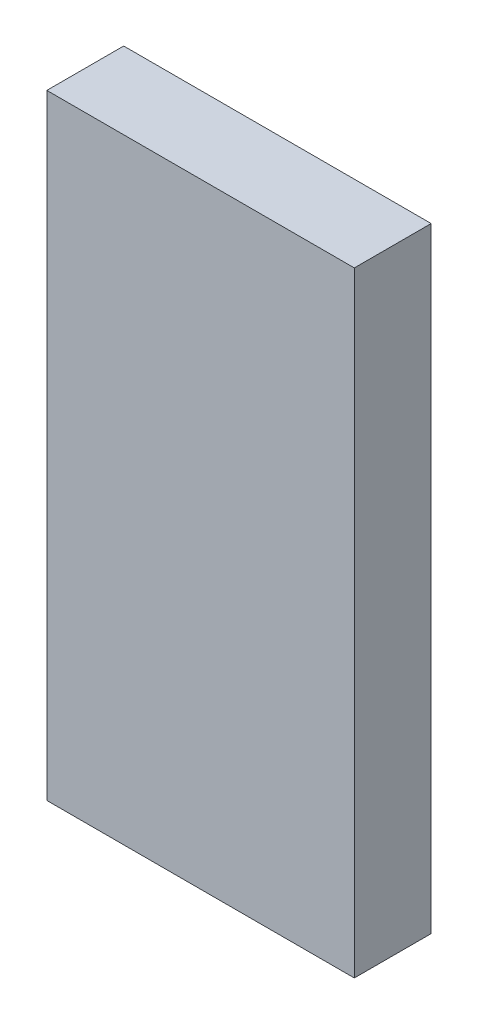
ISO-10303-21;
HEADER;
FILE_DESCRIPTION(('STEP AP214'),'2;1');
FILE_NAME('part.step','',(''),(''),'','','');
FILE_SCHEMA(('AUTOMOTIVE_DESIGN { 1 0 10303 214 1 1 1 1 }'));
ENDSEC;
DATA;
#1=APPLICATION_CONTEXT('core data for automotive mechanical design processes');
#2=APPLICATION_PROTOCOL_DEFINITION('international standard','automotive_design',2000,#1);
#3=PRODUCT_CONTEXT('',#1,'mechanical');
#4=PRODUCT('Part','Part','',(#3));
#5=PRODUCT_RELATED_PRODUCT_CATEGORY('part','',(#4));
#6=PRODUCT_DEFINITION_FORMATION('','',#4);
#7=PRODUCT_DEFINITION_CONTEXT('part definition',#1,'design');
#8=PRODUCT_DEFINITION('design','',#6,#7);
#9=PRODUCT_DEFINITION_SHAPE('','',#8);
#10=(LENGTH_UNIT() NAMED_UNIT(*) SI_UNIT(.MILLI.,.METRE.));
#11=(NAMED_UNIT(*) PLANE_ANGLE_UNIT() SI_UNIT($,.RADIAN.));
#12=(NAMED_UNIT(*) SI_UNIT($,.STERADIAN.) SOLID_ANGLE_UNIT());
#13=UNCERTAINTY_MEASURE_WITH_UNIT(LENGTH_MEASURE(1.E-05),#10,'distance_accuracy_value','');
#14=(GEOMETRIC_REPRESENTATION_CONTEXT(3) GLOBAL_UNCERTAINTY_ASSIGNED_CONTEXT((#13)) GLOBAL_UNIT_ASSIGNED_CONTEXT((#10,
#11,#12)) REPRESENTATION_CONTEXT('',''));
#15=CARTESIAN_POINT('',(0.,0.,0.));
#16=DIRECTION('',(0.,0.,1.));
#17=DIRECTION('',(1.,0.,0.));
#18=AXIS2_PLACEMENT_3D('',#15,#16,#17);
#19=CARTESIAN_POINT('',(0.,0.,0.));
#20=DIRECTION('',(0.,0.,1.));
#21=DIRECTION('',(1.,0.,0.));
#22=AXIS2_PLACEMENT_3D('',#19,#20,#21);
#23=PLANE('',#22);
#24=CARTESIAN_POINT('',(0.0967270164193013,-60.825231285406,0.));
#25=DIRECTION('',(0.,0.,-1.));
#26=DIRECTION('',(-1.,0.,0.));
#27=AXIS2_PLACEMENT_3D('',#24,#25,#26);
#28=CIRCLE('',#27,3.1623);
#29=CARTESIAN_POINT('',(-3.0655729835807,-60.825231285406,0.));
#30=VERTEX_POINT('',#29);
#31=EDGE_CURVE('E344',#30,#30,#28,.T.);
#32=ORIENTED_EDGE('',*,*,#31,.F.);
#33=EDGE_LOOP('',(#32));
#34=FACE_BOUND('',#33,.T.);
#35=DIRECTION('',(0.,-1.,0.));
#36=VECTOR('',#35,1.);
#37=CARTESIAN_POINT('',(-43.2610729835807,34.424768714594,0.));
#38=LINE('',#37,#36);
#39=CARTESIAN_POINT('',(-43.2610729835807,34.424768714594,0.));
#40=VERTEX_POINT('',#39);
#41=CARTESIAN_POINT('',(-43.2610729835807,-67.175231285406,0.));
#42=VERTEX_POINT('',#41);
#43=EDGE_CURVE('E122',#40,#42,#38,.T.);
#44=ORIENTED_EDGE('',*,*,#43,.F.);
#45=DIRECTION('',(-1.,0.,0.));
#46=VECTOR('',#45,1.);
#47=CARTESIAN_POINT('',(-43.2610729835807,34.424768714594,0.));
#48=LINE('',#47,#46);
#49=CARTESIAN_POINT('',(7.5389270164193,34.424768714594,0.));
#50=VERTEX_POINT('',#49);
#51=EDGE_CURVE('E82',#50,#40,#48,.T.);
#52=ORIENTED_EDGE('',*,*,#51,.F.);
#53=DIRECTION('',(0.,1.,0.));
#54=VECTOR('',#53,1.);
#55=CARTESIAN_POINT('',(7.5389270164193,34.424768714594,0.));
#56=LINE('',#55,#54);
#57=CARTESIAN_POINT('',(7.5389270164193,-67.175231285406,0.));
#58=VERTEX_POINT('',#57);
#59=EDGE_CURVE('E76',#58,#50,#56,.T.);
#60=ORIENTED_EDGE('',*,*,#59,.F.);
#61=DIRECTION('',(1.,0.,0.));
#62=VECTOR('',#61,1.);
#63=CARTESIAN_POINT('',(-43.2610729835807,-67.175231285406,0.));
#64=LINE('',#63,#62);
#65=EDGE_CURVE('E132',#42,#58,#64,.T.);
#66=ORIENTED_EDGE('',*,*,#65,.F.);
#67=EDGE_LOOP('',(#44,#52,#60,#66));
#68=FACE_BOUND('',#67,.T.);
#69=CARTESIAN_POINT('',(-35.8242974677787,-60.825231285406,0.));
#70=DIRECTION('',(0.,0.,-1.));
#71=DIRECTION('',(-1.,0.,0.));
#72=AXIS2_PLACEMENT_3D('',#69,#70,#71);
#73=CIRCLE('',#72,3.1623);
#74=CARTESIAN_POINT('',(-38.9865974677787,-60.825231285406,0.));
#75=VERTEX_POINT('',#74);
#76=EDGE_CURVE('E334',#75,#75,#73,.T.);
#77=ORIENTED_EDGE('',*,*,#76,.F.);
#78=EDGE_LOOP('',(#77));
#79=FACE_BOUND('',#78,.T.);
#80=ADVANCED_FACE('F41',(#34,#68,#79),#23,.F.);
#81=CARTESIAN_POINT('',(-43.2610729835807,34.424768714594,12.7));
#82=DIRECTION('',(1.,0.,0.));
#83=DIRECTION('',(0.,0.,-1.));
#84=AXIS2_PLACEMENT_3D('',#81,#82,#83);
#85=PLANE('',#84);
#86=ORIENTED_EDGE('',*,*,#43,.T.);
#87=DIRECTION('',(0.,0.,-1.));
#88=VECTOR('',#87,1.);
#89=CARTESIAN_POINT('',(-43.2610729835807,-67.175231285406,12.7));
#90=LINE('',#89,#88);
#91=CARTESIAN_POINT('',(-43.2610729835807,-67.175231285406,12.7));
#92=VERTEX_POINT('',#91);
#93=EDGE_CURVE('E11',#92,#42,#90,.T.);
#94=ORIENTED_EDGE('',*,*,#93,.F.);
#95=DIRECTION('',(0.,-1.,0.));
#96=VECTOR('',#95,1.);
#97=CARTESIAN_POINT('',(-43.2610729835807,34.424768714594,12.7));
#98=LINE('',#97,#96);
#99=CARTESIAN_POINT('',(-43.2610729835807,34.424768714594,12.7));
#100=VERTEX_POINT('',#99);
#101=EDGE_CURVE('E123',#100,#92,#98,.T.);
#102=ORIENTED_EDGE('',*,*,#101,.F.);
#103=DIRECTION('',(0.,0.,-1.));
#104=VECTOR('',#103,1.);
#105=CARTESIAN_POINT('',(-43.2610729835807,34.424768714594,12.7));
#106=LINE('',#105,#104);
#107=EDGE_CURVE('E129',#100,#40,#106,.T.);
#108=ORIENTED_EDGE('',*,*,#107,.T.);
#109=EDGE_LOOP('',(#86,#94,#102,#108));
#110=FACE_BOUND('',#109,.T.);
#111=ADVANCED_FACE('F43',(#110),#85,.F.);
#112=CARTESIAN_POINT('',(-43.2610729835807,-67.175231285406,12.7));
#113=DIRECTION('',(0.,1.,0.));
#114=DIRECTION('',(0.,0.,1.));
#115=AXIS2_PLACEMENT_3D('',#112,#113,#114);
#116=PLANE('',#115);
#117=CARTESIAN_POINT('',(0.0967270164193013,-67.175231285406,6.35));
#118=DIRECTION('',(0.,-1.,0.));
#119=DIRECTION('',(0.,0.,-1.));
#120=AXIS2_PLACEMENT_3D('',#117,#118,#119);
#121=CIRCLE('',#120,3.1623);
#122=CARTESIAN_POINT('',(0.0967270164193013,-67.175231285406,3.1877));
#123=VERTEX_POINT('',#122);
#124=EDGE_CURVE('E113',#123,#123,#121,.T.);
#125=ORIENTED_EDGE('',*,*,#124,.F.);
#126=EDGE_LOOP('',(#125));
#127=FACE_BOUND('',#126,.T.);
#128=CARTESIAN_POINT('',(-35.8242974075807,-67.175231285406,6.35));
#129=DIRECTION('',(0.,-1.,0.));
#130=DIRECTION('',(0.,0.,-1.));
#131=AXIS2_PLACEMENT_3D('',#128,#129,#130);
#132=CIRCLE('',#131,3.1623);
#133=CARTESIAN_POINT('',(-35.8242974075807,-67.175231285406,3.1877));
#134=VERTEX_POINT('',#133);
#135=EDGE_CURVE('E106',#134,#134,#132,.T.);
#136=ORIENTED_EDGE('',*,*,#135,.F.);
#137=EDGE_LOOP('',(#136));
#138=FACE_BOUND('',#137,.T.);
#139=ORIENTED_EDGE('',*,*,#65,.T.);
#140=DIRECTION('',(0.,0.,-1.));
#141=VECTOR('',#140,1.);
#142=CARTESIAN_POINT('',(7.5389270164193,-67.175231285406,12.7));
#143=LINE('',#142,#141);
#144=CARTESIAN_POINT('',(7.5389270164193,-67.175231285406,12.7));
#145=VERTEX_POINT('',#144);
#146=EDGE_CURVE('E50',#145,#58,#143,.T.);
#147=ORIENTED_EDGE('',*,*,#146,.F.);
#148=DIRECTION('',(1.,0.,0.));
#149=VECTOR('',#148,1.);
#150=CARTESIAN_POINT('',(-43.2610729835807,-67.175231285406,12.7));
#151=LINE('',#150,#149);
#152=EDGE_CURVE('E89',#92,#145,#151,.T.);
#153=ORIENTED_EDGE('',*,*,#152,.F.);
#154=ORIENTED_EDGE('',*,*,#93,.T.);
#155=EDGE_LOOP('',(#139,#147,#153,#154));
#156=FACE_BOUND('',#155,.T.);
#157=ADVANCED_FACE('F156',(#127,#138,#156),#116,.F.);
#158=CARTESIAN_POINT('',(7.5389270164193,34.424768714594,12.7));
#159=DIRECTION('',(-1.,0.,0.));
#160=DIRECTION('',(0.,0.,1.));
#161=AXIS2_PLACEMENT_3D('',#158,#159,#160);
#162=PLANE('',#161);
#163=ORIENTED_EDGE('',*,*,#59,.T.);
#164=DIRECTION('',(0.,0.,-1.));
#165=VECTOR('',#164,1.);
#166=CARTESIAN_POINT('',(7.5389270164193,34.424768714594,12.7));
#167=LINE('',#166,#165);
#168=CARTESIAN_POINT('',(7.5389270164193,34.424768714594,12.7));
#169=VERTEX_POINT('',#168);
#170=EDGE_CURVE('E137',#169,#50,#167,.T.);
#171=ORIENTED_EDGE('',*,*,#170,.F.);
#172=DIRECTION('',(0.,1.,0.));
#173=VECTOR('',#172,1.);
#174=CARTESIAN_POINT('',(7.5389270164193,34.424768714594,12.7));
#175=LINE('',#174,#173);
#176=EDGE_CURVE('E126',#145,#169,#175,.T.);
#177=ORIENTED_EDGE('',*,*,#176,.F.);
#178=ORIENTED_EDGE('',*,*,#146,.T.);
#179=EDGE_LOOP('',(#163,#171,#177,#178));
#180=FACE_BOUND('',#179,.T.);
#181=ADVANCED_FACE('F139',(#180),#162,.F.);
#182=CARTESIAN_POINT('',(-43.2610729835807,34.424768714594,12.7));
#183=DIRECTION('',(0.,-1.,0.));
#184=DIRECTION('',(0.,0.,-1.));
#185=AXIS2_PLACEMENT_3D('',#182,#183,#184);
#186=PLANE('',#185);
#187=ORIENTED_EDGE('',*,*,#51,.T.);
#188=ORIENTED_EDGE('',*,*,#107,.F.);
#189=DIRECTION('',(-1.,0.,0.));
#190=VECTOR('',#189,1.);
#191=CARTESIAN_POINT('',(-43.2610729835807,34.424768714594,12.7));
#192=LINE('',#191,#190);
#193=EDGE_CURVE('E58',#169,#100,#192,.T.);
#194=ORIENTED_EDGE('',*,*,#193,.F.);
#195=ORIENTED_EDGE('',*,*,#170,.T.);
#196=EDGE_LOOP('',(#187,#188,#194,#195));
#197=FACE_BOUND('',#196,.T.);
#198=ADVANCED_FACE('F146',(#197),#186,.F.);
#199=CARTESIAN_POINT('',(0.,0.,12.7));
#200=DIRECTION('',(0.,0.,1.));
#201=DIRECTION('',(1.,0.,0.));
#202=AXIS2_PLACEMENT_3D('',#199,#200,#201);
#203=PLANE('',#202);
#204=ORIENTED_EDGE('',*,*,#101,.T.);
#205=ORIENTED_EDGE('',*,*,#152,.T.);
#206=ORIENTED_EDGE('',*,*,#176,.T.);
#207=ORIENTED_EDGE('',*,*,#193,.T.);
#208=EDGE_LOOP('',(#204,#205,#206,#207));
#209=FACE_BOUND('',#208,.T.);
#210=ADVANCED_FACE('F148',(#209),#203,.T.);
#211=CARTESIAN_POINT('',(-35.8242974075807,-54.475231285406,6.35));
#212=DIRECTION('',(0.,-1.,0.));
#213=DIRECTION('',(0.,0.,-1.));
#214=AXIS2_PLACEMENT_3D('',#211,#212,#213);
#215=CONICAL_SURFACE('',#214,2.5273,1.02974425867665);
#216=CARTESIAN_POINT('',(-35.8242974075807,-52.9566762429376,6.35));
#217=VERTEX_POINT('',#216);
#218=VERTEX_LOOP('',#217);
#219=FACE_BOUND('',#218,.T.);
#220=CARTESIAN_POINT('',(-35.8242974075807,-54.475231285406,6.35));
#221=DIRECTION('',(0.,-1.,0.));
#222=DIRECTION('',(0.,0.,-1.));
#223=AXIS2_PLACEMENT_3D('',#220,#221,#222);
#224=CIRCLE('',#223,2.5273);
#225=CARTESIAN_POINT('',(-35.8242974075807,-54.475231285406,3.8227));
#226=VERTEX_POINT('',#225);
#227=EDGE_CURVE('E119',#226,#226,#224,.T.);
#228=ORIENTED_EDGE('',*,*,#227,.T.);
#229=EDGE_LOOP('',(#228));
#230=FACE_BOUND('',#229,.T.);
#231=ADVANCED_FACE('F154',(#219,#230),#215,.F.);
#232=CARTESIAN_POINT('',(-35.8242974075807,-67.175231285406,6.35));
#233=DIRECTION('',(0.,-1.,0.));
#234=DIRECTION('',(0.,0.,-1.));
#235=AXIS2_PLACEMENT_3D('',#232,#233,#234);
#236=CYLINDRICAL_SURFACE('',#235,2.5273);
#237=CARTESIAN_POINT('',(-35.8242974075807,-59.098031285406,3.8227));
#238=CARTESIAN_POINT('',(-35.7379835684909,-59.0980323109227,3.82270104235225));
#239=CARTESIAN_POINT('',(-35.6516591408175,-59.1045385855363,3.82716059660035));
#240=CARTESIAN_POINT('',(-35.4817706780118,-59.1301540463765,3.84456075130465));
#241=CARTESIAN_POINT('',(-35.3982083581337,-59.1492709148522,3.85750652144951));
#242=CARTESIAN_POINT('',(-35.2365707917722,-59.1989110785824,3.89060908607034));
#243=CARTESIAN_POINT('',(-35.158471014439,-59.2293788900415,3.91073078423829));
#244=CARTESIAN_POINT('',(-35.0088409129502,-59.3003978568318,3.95659064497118));
#245=CARTESIAN_POINT('',(-34.9373113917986,-59.3409502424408,3.98232949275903));
#246=CARTESIAN_POINT('',(-34.7958423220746,-59.434792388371,4.04005288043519));
#247=CARTESIAN_POINT('',(-34.726578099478,-59.488881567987,4.07238541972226));
#248=CARTESIAN_POINT('',(-34.5974760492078,-59.6063139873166,4.13924161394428));
#249=CARTESIAN_POINT('',(-34.5376523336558,-59.6696708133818,4.17376844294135));
#250=CARTESIAN_POINT('',(-34.4189002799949,-59.8160741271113,4.24814761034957));
#251=CARTESIAN_POINT('',(-34.3617884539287,-59.9006419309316,4.28792681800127));
#252=CARTESIAN_POINT('',(-34.2626074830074,-60.0803596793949,4.36198647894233));
#253=CARTESIAN_POINT('',(-34.2205125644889,-60.1754911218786,4.39627629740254));
#254=CARTESIAN_POINT('',(-34.1635875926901,-60.3449471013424,4.44467970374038));
#255=CARTESIAN_POINT('',(-34.1443659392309,-60.4169394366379,4.46175993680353));
#256=CARTESIAN_POINT('',(-34.1153045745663,-60.5641423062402,4.48801697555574));
#257=CARTESIAN_POINT('',(-34.1054477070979,-60.6393466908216,4.49720823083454));
#258=CARTESIAN_POINT('',(-34.0957445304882,-60.7913567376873,4.5062532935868));
#259=CARTESIAN_POINT('',(-34.09594710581,-60.8681684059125,4.50606150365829));
#260=CARTESIAN_POINT('',(-34.1064708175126,-61.0205028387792,4.49625733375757));
#261=CARTESIAN_POINT('',(-34.1167992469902,-61.0960246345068,4.4866381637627));
#262=CARTESIAN_POINT('',(-34.1460219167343,-61.239588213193,4.46029368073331));
#263=CARTESIAN_POINT('',(-34.164417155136,-61.3078132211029,4.44398547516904));
#264=CARTESIAN_POINT('',(-34.2087897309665,-61.44024330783,4.40623335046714));
#265=CARTESIAN_POINT('',(-34.234772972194,-61.5044452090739,4.38478543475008));
#266=CARTESIAN_POINT('',(-34.3082387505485,-61.6590920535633,4.32714888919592));
#267=CARTESIAN_POINT('',(-34.3599928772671,-61.746760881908,4.28892504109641));
#268=CARTESIAN_POINT('',(-34.4774371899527,-61.9112453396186,4.21032098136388));
#269=CARTESIAN_POINT('',(-34.5431536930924,-61.9880400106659,4.16993680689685));
#270=CARTESIAN_POINT('',(-34.6882626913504,-62.130241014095,4.09089319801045));
#271=CARTESIAN_POINT('',(-34.7677748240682,-62.1955367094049,4.05225292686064));
#272=CARTESIAN_POINT('',(-34.9389409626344,-62.3118446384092,3.98104725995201));
#273=CARTESIAN_POINT('',(-35.0305692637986,-62.362886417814,3.94846934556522));
#274=CARTESIAN_POINT('',(-35.2025435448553,-62.4387405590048,3.89912060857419));
#275=CARTESIAN_POINT('',(-35.2808864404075,-62.4668593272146,3.8804465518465));
#276=CARTESIAN_POINT('',(-35.4421209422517,-62.5116908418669,3.85042182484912));
#277=CARTESIAN_POINT('',(-35.5250094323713,-62.5284112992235,3.83906620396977));
#278=CARTESIAN_POINT('',(-35.6933682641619,-62.5495565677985,3.8246758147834));
#279=CARTESIAN_POINT('',(-35.7788465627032,-62.5539385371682,3.82167003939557));
#280=CARTESIAN_POINT('',(-35.9493749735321,-62.5500061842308,3.82435719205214));
#281=CARTESIAN_POINT('',(-36.0344250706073,-62.5416914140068,3.83005042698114));
#282=CARTESIAN_POINT('',(-36.1968109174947,-62.5136837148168,3.8490402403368));
#283=CARTESIAN_POINT('',(-36.2743134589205,-62.4946433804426,3.86190031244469));
#284=CARTESIAN_POINT('',(-36.4247826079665,-62.4466134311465,3.89386786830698));
#285=CARTESIAN_POINT('',(-36.4977483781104,-62.4176219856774,3.91297650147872));
#286=CARTESIAN_POINT('',(-36.6434454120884,-62.3481361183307,3.95782445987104));
#287=CARTESIAN_POINT('',(-36.715701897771,-62.3069133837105,3.9839686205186));
#288=CARTESIAN_POINT('',(-36.8525752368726,-62.2154300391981,4.04015702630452));
#289=CARTESIAN_POINT('',(-36.9171863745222,-62.1651627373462,4.07020415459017));
#290=CARTESIAN_POINT('',(-37.0483819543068,-62.0474673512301,4.13749756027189));
#291=CARTESIAN_POINT('',(-37.1134690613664,-61.9785749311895,4.17510447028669));
#292=CARTESIAN_POINT('',(-37.2317396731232,-61.8308580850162,4.24970494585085));
#293=CARTESIAN_POINT('',(-37.2849172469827,-61.7520287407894,4.28669819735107));
#294=CARTESIAN_POINT('',(-37.3720826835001,-61.5962385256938,4.35146247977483));
#295=CARTESIAN_POINT('',(-37.4076816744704,-61.5204218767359,4.379805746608));
#296=CARTESIAN_POINT('',(-37.4679632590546,-61.3625291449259,4.42980498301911));
#297=CARTESIAN_POINT('',(-37.4926673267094,-61.2804657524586,4.45147408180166));
#298=CARTESIAN_POINT('',(-37.5266176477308,-61.1260038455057,4.48190348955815));
#299=CARTESIAN_POINT('',(-37.5377820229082,-61.0543449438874,4.49223538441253));
#300=CARTESIAN_POINT('',(-37.5509684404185,-60.9095013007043,4.50448090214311));
#301=CARTESIAN_POINT('',(-37.5529992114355,-60.8363180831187,4.50640256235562));
#302=CARTESIAN_POINT('',(-37.5477862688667,-60.6906139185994,4.50153016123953));
#303=CARTESIAN_POINT('',(-37.5405452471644,-60.618092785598,4.49473862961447));
#304=CARTESIAN_POINT('',(-37.517284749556,-60.4755972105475,4.47349280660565));
#305=CARTESIAN_POINT('',(-37.5012528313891,-60.4056265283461,4.45902765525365));
#306=CARTESIAN_POINT('',(-37.454908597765,-60.2481503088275,4.4187937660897));
#307=CARTESIAN_POINT('',(-37.4216906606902,-60.1620518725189,4.39090071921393));
#308=CARTESIAN_POINT('',(-37.343147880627,-59.9978050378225,4.32940002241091));
#309=CARTESIAN_POINT('',(-37.2978046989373,-59.9196689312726,4.29578374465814));
#310=CARTESIAN_POINT('',(-37.1950465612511,-59.7704139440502,4.2257969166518));
#311=CARTESIAN_POINT('',(-37.1373995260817,-59.6994754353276,4.18938354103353));
#312=CARTESIAN_POINT('',(-37.0113264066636,-59.5672454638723,4.11763050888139));
#313=CARTESIAN_POINT('',(-36.9428970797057,-59.5059569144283,4.08229117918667));
#314=CARTESIAN_POINT('',(-36.7859138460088,-59.3866557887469,4.01099627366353));
#315=CARTESIAN_POINT('',(-36.69588951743,-59.3302113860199,3.9756055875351));
#316=CARTESIAN_POINT('',(-36.5045260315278,-59.2340346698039,3.91390235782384));
#317=CARTESIAN_POINT('',(-36.4032098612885,-59.1942691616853,3.8875718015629));
#318=CARTESIAN_POINT('',(-36.221851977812,-59.1425401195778,3.85295699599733));
#319=CARTESIAN_POINT('',(-36.1436867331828,-59.12592733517,3.84169467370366));
#320=CARTESIAN_POINT('',(-35.9851156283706,-59.1036756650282,3.82656786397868));
#321=CARTESIAN_POINT('',(-35.9047111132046,-59.0980303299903,3.82269902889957));
#322=CARTESIAN_POINT('',(-35.8242974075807,-59.098031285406,3.8227));
#323=B_SPLINE_CURVE_WITH_KNOTS('',3,(#237,#238,#239,#240,#241,#242,#243,#244,#245,#246,#247,
#248,#249,#250,#251,#252,#253,#254,#255,#256,#257,#258,#259,#260,#261,#262,#263,#264,#265,#266,
#267,#268,#269,#270,#271,#272,#273,#274,#275,#276,#277,#278,#279,#280,#281,#282,#283,#284,#285,
#286,#287,#288,#289,#290,#291,#292,#293,#294,#295,#296,#297,#298,#299,#300,#301,#302,#303,#304,
#305,#306,#307,#308,#309,#310,#311,#312,#313,#314,#315,#316,#317,#318,#319,#320,#321,#322),
.UNSPECIFIED.,.T.,.F.,(4,2,2,2,2,2,2,2,2,2,2,2,2,2,2,2,2,2,2,2,2,2,2,2,2,2,2,2,2,2,2,2,2,2,2,2,
2,2,2,2,2,2,4),(0.,0.258614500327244,0.517386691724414,0.774910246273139,1.03246523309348,
1.31234647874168,1.59264222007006,1.91972801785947,2.24624970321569,2.47470296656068,
2.70273689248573,2.9318790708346,3.16118640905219,3.37796131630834,3.59490533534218,
3.91944181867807,4.244595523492,4.57272449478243,4.90016818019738,5.1550090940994,
5.40967743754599,5.66522895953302,5.92078949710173,6.16226003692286,6.40377502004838,
6.66438759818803,6.92519379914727,7.2298849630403,7.5347275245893,7.79905290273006,
8.06285493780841,8.28165179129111,8.50023950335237,8.71876376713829,8.93759812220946,
9.22526410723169,9.51336765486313,9.807480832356,10.1016826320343,10.43573406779,
10.7691174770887,11.0101957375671,11.2511321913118),.UNSPECIFIED.);
#324=CARTESIAN_POINT('',(-35.8242974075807,-59.098031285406,3.8227));
#325=VERTEX_POINT('',#324);
#326=EDGE_CURVE('E189',#325,#325,#323,.T.);
#327=ORIENTED_EDGE('',*,*,#326,.T.);
#328=EDGE_LOOP('',(#327));
#329=FACE_BOUND('',#328,.T.);
#330=ORIENTED_EDGE('',*,*,#227,.F.);
#331=EDGE_LOOP('',(#330));
#332=FACE_BOUND('',#331,.T.);
#333=CARTESIAN_POINT('',(-35.8242974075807,-66.540231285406,6.35));
#334=DIRECTION('',(0.,-1.,0.));
#335=DIRECTION('',(0.,0.,-1.));
#336=AXIS2_PLACEMENT_3D('',#333,#334,#335);
#337=CIRCLE('',#336,2.5273);
#338=CARTESIAN_POINT('',(-35.8242974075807,-66.540231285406,3.8227));
#339=VERTEX_POINT('',#338);
#340=EDGE_CURVE('E110',#339,#339,#337,.T.);
#341=ORIENTED_EDGE('',*,*,#340,.T.);
#342=EDGE_LOOP('',(#341));
#343=FACE_BOUND('',#342,.T.);
#344=ADVANCED_FACE('F168',(#329,#332,#343),#236,.F.);
#345=CARTESIAN_POINT('',(-35.8242974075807,-67.175231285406,6.35));
#346=DIRECTION('',(0.,-1.,0.));
#347=DIRECTION('',(0.,0.,-1.));
#348=AXIS2_PLACEMENT_3D('',#345,#346,#347);
#349=CONICAL_SURFACE('',#348,3.1623,0.785398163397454);
#350=ORIENTED_EDGE('',*,*,#340,.F.);
#351=EDGE_LOOP('',(#350));
#352=FACE_BOUND('',#351,.T.);
#353=ORIENTED_EDGE('',*,*,#135,.T.);
#354=EDGE_LOOP('',(#353));
#355=FACE_BOUND('',#354,.T.);
#356=ADVANCED_FACE('F100',(#352,#355),#349,.F.);
#357=CARTESIAN_POINT('',(0.0967270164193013,-54.475231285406,6.35));
#358=DIRECTION('',(0.,-1.,0.));
#359=DIRECTION('',(0.,0.,-1.));
#360=AXIS2_PLACEMENT_3D('',#357,#358,#359);
#361=CONICAL_SURFACE('',#360,2.5273,1.02974425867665);
#362=CARTESIAN_POINT('',(0.0967270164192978,-52.9566762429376,6.35));
#363=VERTEX_POINT('',#362);
#364=VERTEX_LOOP('',#363);
#365=FACE_BOUND('',#364,.T.);
#366=CARTESIAN_POINT('',(0.0967270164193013,-54.475231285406,6.35));
#367=DIRECTION('',(0.,-1.,0.));
#368=DIRECTION('',(0.,0.,-1.));
#369=AXIS2_PLACEMENT_3D('',#366,#367,#368);
#370=CIRCLE('',#369,2.5273);
#371=CARTESIAN_POINT('',(0.0967270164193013,-54.475231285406,3.8227));
#372=VERTEX_POINT('',#371);
#373=EDGE_CURVE('E104',#372,#372,#370,.T.);
#374=ORIENTED_EDGE('',*,*,#373,.T.);
#375=EDGE_LOOP('',(#374));
#376=FACE_BOUND('',#375,.T.);
#377=ADVANCED_FACE('F96',(#365,#376),#361,.F.);
#378=CARTESIAN_POINT('',(0.0967270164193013,-67.175231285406,6.35));
#379=DIRECTION('',(0.,-1.,0.));
#380=DIRECTION('',(0.,0.,-1.));
#381=AXIS2_PLACEMENT_3D('',#378,#379,#380);
#382=CYLINDRICAL_SURFACE('',#381,2.5273);
#383=CARTESIAN_POINT('',(0.0967270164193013,-59.098031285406,3.8227));
#384=CARTESIAN_POINT('',(0.183040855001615,-59.0980323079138,3.82270104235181));
#385=CARTESIAN_POINT('',(0.269365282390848,-59.1045385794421,3.8271605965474));
#386=CARTESIAN_POINT('',(0.439253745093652,-59.1301540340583,3.84456075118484));
#387=CARTESIAN_POINT('',(0.522816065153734,-59.149270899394,3.85750652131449));
#388=CARTESIAN_POINT('',(0.684453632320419,-59.1989110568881,3.89060908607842));
#389=CARTESIAN_POINT('',(0.762553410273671,-59.2293788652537,3.91073078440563));
#390=CARTESIAN_POINT('',(0.91218351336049,-59.3003978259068,3.95659064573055));
#391=CARTESIAN_POINT('',(0.983713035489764,-59.3409502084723,3.98232949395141));
#392=CARTESIAN_POINT('',(1.12518210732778,-59.4347923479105,4.04005288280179));
#393=CARTESIAN_POINT('',(1.19444633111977,-59.488881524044,4.07238542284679));
#394=CARTESIAN_POINT('',(1.32354838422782,-59.6063139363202,4.13924161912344));
#395=CARTESIAN_POINT('',(1.38337210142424,-59.6696707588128,4.17376844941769));
#396=CARTESIAN_POINT('',(1.502124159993,-59.8160740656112,4.24814762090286));
#397=CARTESIAN_POINT('',(1.55923598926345,-59.9006418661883,4.28792683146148));
#398=CARTESIAN_POINT('',(1.65841696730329,-60.0803596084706,4.3619864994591));
#399=CARTESIAN_POINT('',(1.70051188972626,-60.1754910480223,4.39627632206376));
#400=CARTESIAN_POINT('',(1.75743686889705,-60.3449470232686,4.4446797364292));
#401=CARTESIAN_POINT('',(1.7766585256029,-60.4169393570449,4.46175997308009));
#402=CARTESIAN_POINT('',(1.80571989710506,-60.5641422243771,4.4880170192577));
#403=CARTESIAN_POINT('',(1.81557676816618,-60.6393466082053,4.49720827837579));
#404=CARTESIAN_POINT('',(1.82527995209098,-60.7913566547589,4.50625334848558));
#405=CARTESIAN_POINT('',(1.82507738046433,-60.8681683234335,4.50606156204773));
#406=CARTESIAN_POINT('',(1.81455367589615,-61.0205027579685,4.49625739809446));
#407=CARTESIAN_POINT('',(1.80422524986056,-61.096024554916,4.48663823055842));
#408=CARTESIAN_POINT('',(1.77500258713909,-61.2395881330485,4.46029375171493));
#409=CARTESIAN_POINT('',(1.75660735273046,-61.3078131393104,4.44398554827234));
#410=CARTESIAN_POINT('',(1.71223478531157,-61.4402432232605,4.4062334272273));
#411=CARTESIAN_POINT('',(1.68625154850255,-61.5044451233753,4.38478551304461));
#412=CARTESIAN_POINT('',(1.61278578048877,-61.6590919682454,4.3271489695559));
#413=CARTESIAN_POINT('',(1.56103165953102,-61.7467607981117,4.28892512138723));
#414=CARTESIAN_POINT('',(1.44358735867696,-61.9112452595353,4.21032105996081));
#415=CARTESIAN_POINT('',(1.37787086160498,-61.9880399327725,4.1699368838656));
#416=CARTESIAN_POINT('',(1.23276187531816,-62.1302409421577,4.09089326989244));
#417=CARTESIAN_POINT('',(1.15324974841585,-62.1955366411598,4.05225299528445));
#418=CARTESIAN_POINT('',(0.982083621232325,-62.3118445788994,3.98104731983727));
#419=CARTESIAN_POINT('',(0.890455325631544,-62.3628863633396,3.94846940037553));
#420=CARTESIAN_POINT('',(0.718481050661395,-62.4387405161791,3.89912065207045));
#421=CARTESIAN_POINT('',(0.640138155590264,-62.4668592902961,3.88044658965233));
#422=CARTESIAN_POINT('',(0.478903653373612,-62.5116908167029,3.85042185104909));
#423=CARTESIAN_POINT('',(0.39601516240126,-62.5284112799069,3.83906622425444));
#424=CARTESIAN_POINT('',(0.227656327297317,-62.5495565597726,3.82467582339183));
#425=CARTESIAN_POINT('',(0.142178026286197,-62.5539385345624,3.82167004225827));
#426=CARTESIAN_POINT('',(-0.0283503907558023,-62.5500061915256,3.82435718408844));
#427=CARTESIAN_POINT('',(-0.113400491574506,-62.5416914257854,3.83005041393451));
#428=CARTESIAN_POINT('',(-0.275786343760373,-62.5136837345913,3.84904021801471));
#429=CARTESIAN_POINT('',(-0.353288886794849,-62.4946434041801,3.8619002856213));
#430=CARTESIAN_POINT('',(-0.503758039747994,-62.446613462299,3.89386783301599));
#431=CARTESIAN_POINT('',(-0.57672381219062,-62.4176220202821,3.91297646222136));
#432=CARTESIAN_POINT('',(-0.72242084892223,-62.3481361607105,3.95782441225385));
#433=CARTESIAN_POINT('',(-0.794677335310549,-62.306913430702,3.98396856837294));
#434=CARTESIAN_POINT('',(-0.931550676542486,-62.2154300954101,4.04015696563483));
#435=CARTESIAN_POINT('',(-0.99616181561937,-62.1651627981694,4.07020408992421));
#436=CARTESIAN_POINT('',(-1.12735739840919,-62.0474674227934,4.13749748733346));
#437=CARTESIAN_POINT('',(-1.19244450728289,-61.9785750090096,4.17510439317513));
#438=CARTESIAN_POINT('',(-1.3107151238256,-61.8308581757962,4.24970486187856));
#439=CARTESIAN_POINT('',(-1.36389270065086,-61.7520288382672,4.28669811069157));
#440=CARTESIAN_POINT('',(-1.45105814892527,-61.5962386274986,4.35146239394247));
#441=CARTESIAN_POINT('',(-1.48665714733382,-61.5204219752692,4.37980566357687));
#442=CARTESIAN_POINT('',(-1.54693874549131,-61.3625292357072,4.42980490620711));
#443=CARTESIAN_POINT('',(-1.57164281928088,-61.2804658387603,4.45147400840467));
#444=CARTESIAN_POINT('',(-1.60559314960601,-61.126003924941,4.48190342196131));
#445=CARTESIAN_POINT('',(-1.61675752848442,-61.054345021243,4.49223531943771));
#446=CARTESIAN_POINT('',(-1.62994395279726,-60.90950137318,4.50448084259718));
#447=CARTESIAN_POINT('',(-1.63197472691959,-60.8363181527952,4.50640250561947));
#448=CARTESIAN_POINT('',(-1.62676178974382,-60.6906139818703,4.50153010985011));
#449=CARTESIAN_POINT('',(-1.61952077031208,-60.6180928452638,4.49473858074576));
#450=CARTESIAN_POINT('',(-1.59626027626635,-60.4755972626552,4.47349276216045));
#451=CARTESIAN_POINT('',(-1.58022835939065,-60.4056265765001,4.45902761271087));
#452=CARTESIAN_POINT('',(-1.53388412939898,-60.2481503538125,4.41879372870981));
#453=CARTESIAN_POINT('',(-1.50066619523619,-60.1620519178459,4.39090068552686));
#454=CARTESIAN_POINT('',(-1.42212342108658,-59.9978050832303,4.32939999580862));
#455=CARTESIAN_POINT('',(-1.37678024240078,-59.9196689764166,4.29578372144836));
#456=CARTESIAN_POINT('',(-1.27402211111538,-59.7704139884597,4.2257968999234));
#457=CARTESIAN_POINT('',(-1.21637507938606,-59.6994754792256,4.18938352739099));
#458=CARTESIAN_POINT('',(-1.09030196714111,-59.5672455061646,4.11763050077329));
#459=CARTESIAN_POINT('',(-1.02187264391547,-59.5059569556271,4.08229117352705));
#460=CARTESIAN_POINT('',(-0.864889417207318,-59.3866558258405,4.01099627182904));
#461=CARTESIAN_POINT('',(-0.77486509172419,-59.3302114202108,3.9756055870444));
#462=CARTESIAN_POINT('',(-0.583501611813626,-59.2340346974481,3.91390235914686));
#463=CARTESIAN_POINT('',(-0.482185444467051,-59.1942691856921,3.88757180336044));
#464=CARTESIAN_POINT('',(-0.300827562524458,-59.1425401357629,3.85295699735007));
#465=CARTESIAN_POINT('',(-0.222662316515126,-59.1259273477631,3.84169467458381));
#466=CARTESIAN_POINT('',(-0.0640912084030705,-59.1036756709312,3.82656786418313));
#467=CARTESIAN_POINT('',(0.0163133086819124,-59.0980303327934,3.82269902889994));
#468=CARTESIAN_POINT('',(0.0967270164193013,-59.098031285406,3.8227));
#469=B_SPLINE_CURVE_WITH_KNOTS('',3,(#383,#384,#385,#386,#387,#388,#389,#390,#391,#392,#393,
#394,#395,#396,#397,#398,#399,#400,#401,#402,#403,#404,#405,#406,#407,#408,#409,#410,#411,#412,
#413,#414,#415,#416,#417,#418,#419,#420,#421,#422,#423,#424,#425,#426,#427,#428,#429,#430,#431,
#432,#433,#434,#435,#436,#437,#438,#439,#440,#441,#442,#443,#444,#445,#446,#447,#448,#449,#450,
#451,#452,#453,#454,#455,#456,#457,#458,#459,#460,#461,#462,#463,#464,#465,#466,#467,#468),
.UNSPECIFIED.,.T.,.F.,(4,2,2,2,2,2,2,2,2,2,2,2,2,2,2,2,2,2,2,2,2,2,2,2,2,2,2,2,2,2,2,2,2,2,2,2,
2,2,2,2,2,2,4),(0.,0.258614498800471,0.517386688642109,0.774910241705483,1.03246522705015,
1.3123464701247,1.5926422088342,1.91972800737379,2.24624969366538,2.47470295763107,
2.70273688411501,2.93187906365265,3.16118640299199,3.37796130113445,3.59490531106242,
3.91944178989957,4.24459549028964,4.57272445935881,4.90016814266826,5.1550090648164,
5.40967741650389,5.66522894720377,5.92078949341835,6.16226003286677,6.40377501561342,
6.66438758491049,6.92519377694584,7.22988492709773,7.53472747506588,7.79905287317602,
8.06285492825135,8.2816517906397,8.50023951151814,8.71876378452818,8.93759814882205,
9.22526412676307,9.51336766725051,9.80748083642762,10.1016826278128,10.4357340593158,
10.7691174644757,11.0101957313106,11.251132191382),.UNSPECIFIED.);
#470=CARTESIAN_POINT('',(0.0967270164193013,-59.098031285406,3.8227));
#471=VERTEX_POINT('',#470);
#472=EDGE_CURVE('E328',#471,#471,#469,.T.);
#473=ORIENTED_EDGE('',*,*,#472,.T.);
#474=EDGE_LOOP('',(#473));
#475=FACE_BOUND('',#474,.T.);
#476=ORIENTED_EDGE('',*,*,#373,.F.);
#477=EDGE_LOOP('',(#476));
#478=FACE_BOUND('',#477,.T.);
#479=CARTESIAN_POINT('',(0.0967270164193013,-66.540231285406,6.35));
#480=DIRECTION('',(0.,-1.,0.));
#481=DIRECTION('',(0.,0.,-1.));
#482=AXIS2_PLACEMENT_3D('',#479,#480,#481);
#483=CIRCLE('',#482,2.5273);
#484=CARTESIAN_POINT('',(0.0967270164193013,-66.540231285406,3.8227));
#485=VERTEX_POINT('',#484);
#486=EDGE_CURVE('E107',#485,#485,#483,.T.);
#487=ORIENTED_EDGE('',*,*,#486,.T.);
#488=EDGE_LOOP('',(#487));
#489=FACE_BOUND('',#488,.T.);
#490=ADVANCED_FACE('F99',(#475,#478,#489),#382,.F.);
#491=CARTESIAN_POINT('',(0.0967270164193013,-67.175231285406,6.35));
#492=DIRECTION('',(0.,-1.,0.));
#493=DIRECTION('',(0.,0.,-1.));
#494=AXIS2_PLACEMENT_3D('',#491,#492,#493);
#495=CONICAL_SURFACE('',#494,3.1623,0.785398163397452);
#496=ORIENTED_EDGE('',*,*,#486,.F.);
#497=EDGE_LOOP('',(#496));
#498=FACE_BOUND('',#497,.T.);
#499=ORIENTED_EDGE('',*,*,#124,.T.);
#500=EDGE_LOOP('',(#499));
#501=FACE_BOUND('',#500,.T.);
#502=ADVANCED_FACE('F178',(#498,#501),#495,.F.);
#503=CARTESIAN_POINT('',(-35.8242974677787,-60.825231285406,0.));
#504=DIRECTION('',(0.,0.,-1.));
#505=DIRECTION('',(-1.,0.,0.));
#506=AXIS2_PLACEMENT_3D('',#503,#504,#505);
#507=CYLINDRICAL_SURFACE('',#506,1.7272);
#508=ORIENTED_EDGE('',*,*,#326,.F.);
#509=EDGE_LOOP('',(#508));
#510=FACE_BOUND('',#509,.T.);
#511=CARTESIAN_POINT('',(-35.8242974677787,-60.825231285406,1.4351));
#512=DIRECTION('',(0.,0.,-1.));
#513=DIRECTION('',(-1.,0.,0.));
#514=AXIS2_PLACEMENT_3D('',#511,#512,#513);
#515=CIRCLE('',#514,1.7272);
#516=CARTESIAN_POINT('',(-37.5514974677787,-60.825231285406,1.4351));
#517=VERTEX_POINT('',#516);
#518=EDGE_CURVE('E195',#517,#517,#515,.T.);
#519=ORIENTED_EDGE('',*,*,#518,.T.);
#520=EDGE_LOOP('',(#519));
#521=FACE_BOUND('',#520,.T.);
#522=ADVANCED_FACE('F182',(#510,#521),#507,.F.);
#523=CARTESIAN_POINT('',(-35.8242974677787,-60.825231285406,0.));
#524=DIRECTION('',(0.,0.,-1.));
#525=DIRECTION('',(-1.,0.,0.));
#526=AXIS2_PLACEMENT_3D('',#523,#524,#525);
#527=CONICAL_SURFACE('',#526,3.1623,0.785398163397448);
#528=ORIENTED_EDGE('',*,*,#518,.F.);
#529=EDGE_LOOP('',(#528));
#530=FACE_BOUND('',#529,.T.);
#531=ORIENTED_EDGE('',*,*,#76,.T.);
#532=EDGE_LOOP('',(#531));
#533=FACE_BOUND('',#532,.T.);
#534=ADVANCED_FACE('F258',(#530,#533),#527,.F.);
#535=CARTESIAN_POINT('',(0.0967270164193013,-60.825231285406,0.));
#536=DIRECTION('',(0.,0.,-1.));
#537=DIRECTION('',(-1.,0.,0.));
#538=AXIS2_PLACEMENT_3D('',#535,#536,#537);
#539=CYLINDRICAL_SURFACE('',#538,1.7272);
#540=ORIENTED_EDGE('',*,*,#472,.F.);
#541=EDGE_LOOP('',(#540));
#542=FACE_BOUND('',#541,.T.);
#543=CARTESIAN_POINT('',(0.0967270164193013,-60.825231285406,1.4351));
#544=DIRECTION('',(0.,0.,-1.));
#545=DIRECTION('',(-1.,0.,0.));
#546=AXIS2_PLACEMENT_3D('',#543,#544,#545);
#547=CIRCLE('',#546,1.7272);
#548=CARTESIAN_POINT('',(-1.6304729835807,-60.825231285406,1.4351));
#549=VERTEX_POINT('',#548);
#550=EDGE_CURVE('E335',#549,#549,#547,.T.);
#551=ORIENTED_EDGE('',*,*,#550,.T.);
#552=EDGE_LOOP('',(#551));
#553=FACE_BOUND('',#552,.T.);
#554=ADVANCED_FACE('F267',(#542,#553),#539,.F.);
#555=CARTESIAN_POINT('',(0.0967270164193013,-60.825231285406,0.));
#556=DIRECTION('',(0.,0.,-1.));
#557=DIRECTION('',(-1.,0.,0.));
#558=AXIS2_PLACEMENT_3D('',#555,#556,#557);
#559=CONICAL_SURFACE('',#558,3.1623,0.785398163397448);
#560=ORIENTED_EDGE('',*,*,#550,.F.);
#561=EDGE_LOOP('',(#560));
#562=FACE_BOUND('',#561,.T.);
#563=ORIENTED_EDGE('',*,*,#31,.T.);
#564=EDGE_LOOP('',(#563));
#565=FACE_BOUND('',#564,.T.);
#566=ADVANCED_FACE('F274',(#562,#565),#559,.F.);
#567=CLOSED_SHELL('',(#80,#111,#157,#181,#198,#210,#231,#344,#356,#377,#490,#502,#522,#534,#554,#566));
#568=MANIFOLD_SOLID_BREP('B2',#567);
#569=ADVANCED_BREP_SHAPE_REPRESENTATION('',(#18,#568),#14);
#570=SHAPE_DEFINITION_REPRESENTATION(#9,#569);
ENDSEC;
END-ISO-10303-21;
